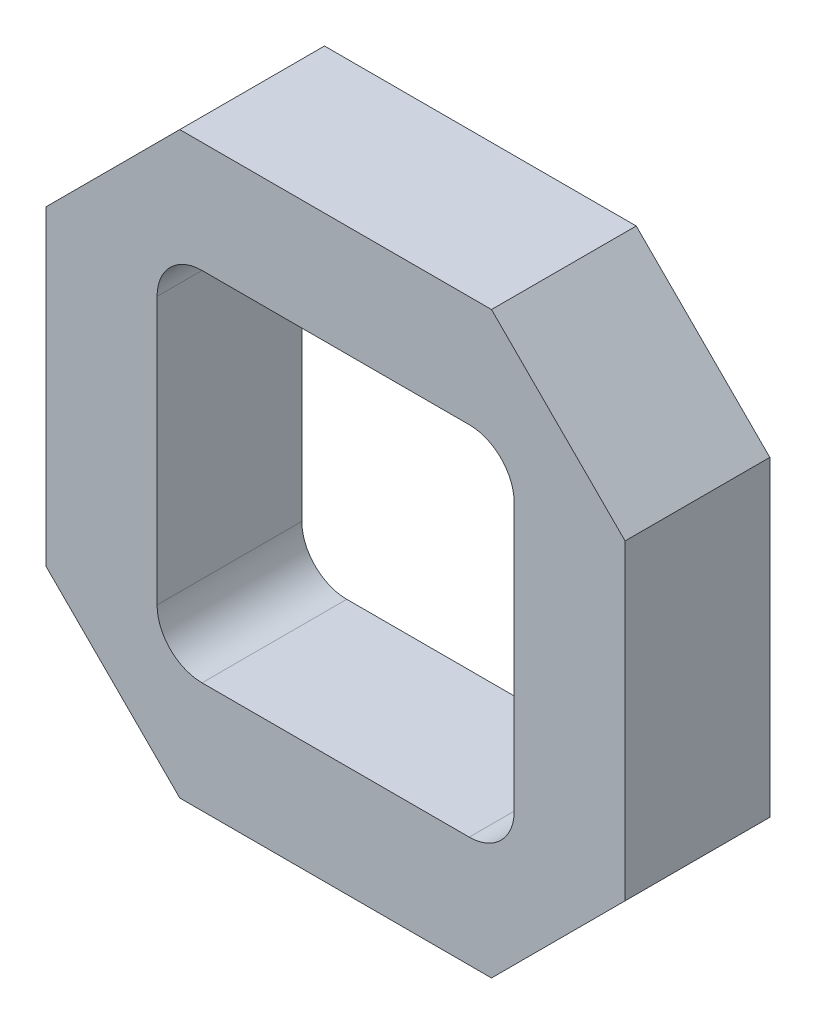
ISO-10303-21;
HEADER;
FILE_DESCRIPTION(('STEP AP214'),'2;1');
FILE_NAME('part.step','',(''),(''),'','','');
FILE_SCHEMA(('AUTOMOTIVE_DESIGN { 1 0 10303 214 1 1 1 1 }'));
ENDSEC;
DATA;
#1=APPLICATION_CONTEXT('core data for automotive mechanical design processes');
#2=APPLICATION_PROTOCOL_DEFINITION('international standard','automotive_design',2000,#1);
#3=PRODUCT_CONTEXT('',#1,'mechanical');
#4=PRODUCT('Part','Part','',(#3));
#5=PRODUCT_RELATED_PRODUCT_CATEGORY('part','',(#4));
#6=PRODUCT_DEFINITION_FORMATION('','',#4);
#7=PRODUCT_DEFINITION_CONTEXT('part definition',#1,'design');
#8=PRODUCT_DEFINITION('design','',#6,#7);
#9=PRODUCT_DEFINITION_SHAPE('','',#8);
#10=(LENGTH_UNIT() NAMED_UNIT(*) SI_UNIT(.MILLI.,.METRE.));
#11=(NAMED_UNIT(*) PLANE_ANGLE_UNIT() SI_UNIT($,.RADIAN.));
#12=(NAMED_UNIT(*) SI_UNIT($,.STERADIAN.) SOLID_ANGLE_UNIT());
#13=UNCERTAINTY_MEASURE_WITH_UNIT(LENGTH_MEASURE(1.E-05),#10,'distance_accuracy_value','');
#14=(GEOMETRIC_REPRESENTATION_CONTEXT(3) GLOBAL_UNCERTAINTY_ASSIGNED_CONTEXT((#13)) GLOBAL_UNIT_ASSIGNED_CONTEXT((#10,
#11,#12)) REPRESENTATION_CONTEXT('',''));
#15=CARTESIAN_POINT('',(0.,0.,0.));
#16=DIRECTION('',(0.,0.,1.));
#17=DIRECTION('',(1.,0.,0.));
#18=AXIS2_PLACEMENT_3D('',#15,#16,#17);
#19=CARTESIAN_POINT('',(-165.1,165.1,101.6));
#20=DIRECTION('',(0.,-1.,0.));
#21=DIRECTION('',(1.,0.,0.));
#22=AXIS2_PLACEMENT_3D('',#19,#20,#21);
#23=PLANE('',#22);
#24=DIRECTION('',(1.,0.,0.));
#25=VECTOR('',#24,1.);
#26=CARTESIAN_POINT('',(-165.1,165.1,19.05));
#27=LINE('',#26,#25);
#28=CARTESIAN_POINT('',(-88.8999999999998,165.1,19.05));
#29=VERTEX_POINT('',#28);
#30=CARTESIAN_POINT('',(88.9,165.1,19.05));
#31=VERTEX_POINT('',#30);
#32=EDGE_CURVE('E70',#29,#31,#27,.T.);
#33=ORIENTED_EDGE('',*,*,#32,.F.);
#34=DIRECTION('',(0.,0.,1.));
#35=VECTOR('',#34,1.);
#36=CARTESIAN_POINT('',(-88.8999999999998,165.1,101.6));
#37=LINE('',#36,#35);
#38=CARTESIAN_POINT('',(-88.8999999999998,165.1,101.6));
#39=VERTEX_POINT('',#38);
#40=EDGE_CURVE('E176',#29,#39,#37,.T.);
#41=ORIENTED_EDGE('',*,*,#40,.T.);
#42=DIRECTION('',(-1.,0.,0.));
#43=VECTOR('',#42,1.);
#44=CARTESIAN_POINT('',(-165.1,165.1,101.6));
#45=LINE('',#44,#43);
#46=CARTESIAN_POINT('',(88.9,165.1,101.6));
#47=VERTEX_POINT('',#46);
#48=EDGE_CURVE('E222',#47,#39,#45,.T.);
#49=ORIENTED_EDGE('',*,*,#48,.F.);
#50=DIRECTION('',(0.,0.,-1.));
#51=VECTOR('',#50,1.);
#52=CARTESIAN_POINT('',(88.9,165.1,101.6));
#53=LINE('',#52,#51);
#54=EDGE_CURVE('E181',#47,#31,#53,.T.);
#55=ORIENTED_EDGE('',*,*,#54,.T.);
#56=EDGE_LOOP('',(#33,#41,#49,#55));
#57=FACE_BOUND('',#56,.T.);
#58=ADVANCED_FACE('F45',(#57),#23,.F.);
#59=CARTESIAN_POINT('',(-165.1,-165.1,101.6));
#60=DIRECTION('',(1.,0.,0.));
#61=DIRECTION('',(0.,1.,0.));
#62=AXIS2_PLACEMENT_3D('',#59,#60,#61);
#63=PLANE('',#62);
#64=DIRECTION('',(0.,1.,0.));
#65=VECTOR('',#64,1.);
#66=CARTESIAN_POINT('',(-165.1,-165.1,19.05));
#67=LINE('',#66,#65);
#68=CARTESIAN_POINT('',(-165.1,-88.8999999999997,19.05));
#69=VERTEX_POINT('',#68);
#70=CARTESIAN_POINT('',(-165.1,88.9,19.05));
#71=VERTEX_POINT('',#70);
#72=EDGE_CURVE('E316',#69,#71,#67,.T.);
#73=ORIENTED_EDGE('',*,*,#72,.F.);
#74=DIRECTION('',(0.,0.,1.));
#75=VECTOR('',#74,1.);
#76=CARTESIAN_POINT('',(-165.1,-88.8999999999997,101.6));
#77=LINE('',#76,#75);
#78=CARTESIAN_POINT('',(-165.1,-88.8999999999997,101.6));
#79=VERTEX_POINT('',#78);
#80=EDGE_CURVE('E197',#69,#79,#77,.T.);
#81=ORIENTED_EDGE('',*,*,#80,.T.);
#82=DIRECTION('',(0.,-1.,0.));
#83=VECTOR('',#82,1.);
#84=CARTESIAN_POINT('',(-165.1,-165.1,101.6));
#85=LINE('',#84,#83);
#86=CARTESIAN_POINT('',(-165.1,88.9,101.6));
#87=VERTEX_POINT('',#86);
#88=EDGE_CURVE('E218',#87,#79,#85,.T.);
#89=ORIENTED_EDGE('',*,*,#88,.F.);
#90=DIRECTION('',(0.,0.,-1.));
#91=VECTOR('',#90,1.);
#92=CARTESIAN_POINT('',(-165.1,88.9,101.6));
#93=LINE('',#92,#91);
#94=EDGE_CURVE('E200',#87,#71,#93,.T.);
#95=ORIENTED_EDGE('',*,*,#94,.T.);
#96=EDGE_LOOP('',(#73,#81,#89,#95));
#97=FACE_BOUND('',#96,.T.);
#98=ADVANCED_FACE('F391',(#97),#63,.F.);
#99=CARTESIAN_POINT('',(-165.1,-165.1,101.6));
#100=DIRECTION('',(0.,1.,0.));
#101=DIRECTION('',(-1.,0.,0.));
#102=AXIS2_PLACEMENT_3D('',#99,#100,#101);
#103=PLANE('',#102);
#104=DIRECTION('',(-1.,0.,0.));
#105=VECTOR('',#104,1.);
#106=CARTESIAN_POINT('',(-165.1,-165.1,19.05));
#107=LINE('',#106,#105);
#108=CARTESIAN_POINT('',(88.8999999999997,-165.1,19.05));
#109=VERTEX_POINT('',#108);
#110=CARTESIAN_POINT('',(-88.8999999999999,-165.1,19.05));
#111=VERTEX_POINT('',#110);
#112=EDGE_CURVE('E319',#109,#111,#107,.T.);
#113=ORIENTED_EDGE('',*,*,#112,.F.);
#114=DIRECTION('',(0.,0.,1.));
#115=VECTOR('',#114,1.);
#116=CARTESIAN_POINT('',(88.8999999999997,-165.1,101.6));
#117=LINE('',#116,#115);
#118=CARTESIAN_POINT('',(88.8999999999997,-165.1,101.6));
#119=VERTEX_POINT('',#118);
#120=EDGE_CURVE('E208',#109,#119,#117,.T.);
#121=ORIENTED_EDGE('',*,*,#120,.T.);
#122=DIRECTION('',(1.,0.,0.));
#123=VECTOR('',#122,1.);
#124=CARTESIAN_POINT('',(-165.1,-165.1,101.6));
#125=LINE('',#124,#123);
#126=CARTESIAN_POINT('',(-88.8999999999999,-165.1,101.6));
#127=VERTEX_POINT('',#126);
#128=EDGE_CURVE('E214',#127,#119,#125,.T.);
#129=ORIENTED_EDGE('',*,*,#128,.F.);
#130=DIRECTION('',(0.,0.,-1.));
#131=VECTOR('',#130,1.);
#132=CARTESIAN_POINT('',(-88.8999999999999,-165.1,101.6));
#133=LINE('',#132,#131);
#134=EDGE_CURVE('E204',#127,#111,#133,.T.);
#135=ORIENTED_EDGE('',*,*,#134,.T.);
#136=EDGE_LOOP('',(#113,#121,#129,#135));
#137=FACE_BOUND('',#136,.T.);
#138=ADVANCED_FACE('F382',(#137),#103,.F.);
#139=CARTESIAN_POINT('',(165.1,-165.1,101.6));
#140=DIRECTION('',(-1.,0.,0.));
#141=DIRECTION('',(0.,0.,1.));
#142=AXIS2_PLACEMENT_3D('',#139,#140,#141);
#143=PLANE('',#142);
#144=DIRECTION('',(0.,-1.,0.));
#145=VECTOR('',#144,1.);
#146=CARTESIAN_POINT('',(165.1,-165.1,19.05));
#147=LINE('',#146,#145);
#148=CARTESIAN_POINT('',(165.1,88.8999999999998,19.05));
#149=VERTEX_POINT('',#148);
#150=CARTESIAN_POINT('',(165.1,-88.9,19.05));
#151=VERTEX_POINT('',#150);
#152=EDGE_CURVE('E158',#149,#151,#147,.T.);
#153=ORIENTED_EDGE('',*,*,#152,.F.);
#154=DIRECTION('',(0.,0.,1.));
#155=VECTOR('',#154,1.);
#156=CARTESIAN_POINT('',(165.1,88.8999999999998,101.6));
#157=LINE('',#156,#155);
#158=CARTESIAN_POINT('',(165.1,88.8999999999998,101.6));
#159=VERTEX_POINT('',#158);
#160=EDGE_CURVE('E168',#149,#159,#157,.T.);
#161=ORIENTED_EDGE('',*,*,#160,.T.);
#162=DIRECTION('',(0.,1.,0.));
#163=VECTOR('',#162,1.);
#164=CARTESIAN_POINT('',(165.1,-165.1,101.6));
#165=LINE('',#164,#163);
#166=CARTESIAN_POINT('',(165.1,-88.9,101.6));
#167=VERTEX_POINT('',#166);
#168=EDGE_CURVE('E211',#167,#159,#165,.T.);
#169=ORIENTED_EDGE('',*,*,#168,.F.);
#170=DIRECTION('',(0.,0.,-1.));
#171=VECTOR('',#170,1.);
#172=CARTESIAN_POINT('',(165.1,-88.9,101.6));
#173=LINE('',#172,#171);
#174=EDGE_CURVE('E55',#167,#151,#173,.T.);
#175=ORIENTED_EDGE('',*,*,#174,.T.);
#176=EDGE_LOOP('',(#153,#161,#169,#175));
#177=FACE_BOUND('',#176,.T.);
#178=ADVANCED_FACE('F166',(#177),#143,.F.);
#179=CARTESIAN_POINT('',(-76.2,-76.2,101.6));
#180=DIRECTION('',(0.,0.,-1.));
#181=DIRECTION('',(-1.,0.,0.));
#182=AXIS2_PLACEMENT_3D('',#179,#180,#181);
#183=CYLINDRICAL_SURFACE('',#182,25.654);
#184=DIRECTION('',(0.,0.,-1.));
#185=VECTOR('',#184,1.);
#186=CARTESIAN_POINT('',(-76.2,-101.854,101.6));
#187=LINE('',#186,#185);
#188=CARTESIAN_POINT('',(-76.2,-101.854,101.6));
#189=VERTEX_POINT('',#188);
#190=CARTESIAN_POINT('',(-76.2,-101.854,19.05));
#191=VERTEX_POINT('',#190);
#192=EDGE_CURVE('E226',#189,#191,#187,.T.);
#193=ORIENTED_EDGE('',*,*,#192,.T.);
#194=CARTESIAN_POINT('',(-76.2,-76.2,19.05));
#195=DIRECTION('',(0.,0.,-1.));
#196=DIRECTION('',(-1.,0.,0.));
#197=AXIS2_PLACEMENT_3D('',#194,#195,#196);
#198=CIRCLE('',#197,25.654);
#199=CARTESIAN_POINT('',(-101.854,-76.2,19.05));
#200=VERTEX_POINT('',#199);
#201=EDGE_CURVE('E283',#191,#200,#198,.T.);
#202=ORIENTED_EDGE('',*,*,#201,.T.);
#203=DIRECTION('',(0.,0.,-1.));
#204=VECTOR('',#203,1.);
#205=CARTESIAN_POINT('',(-101.854,-76.2,101.6));
#206=LINE('',#205,#204);
#207=CARTESIAN_POINT('',(-101.854,-76.2,101.6));
#208=VERTEX_POINT('',#207);
#209=EDGE_CURVE('E254',#208,#200,#206,.T.);
#210=ORIENTED_EDGE('',*,*,#209,.F.);
#211=CARTESIAN_POINT('',(-76.2,-76.2,101.6));
#212=DIRECTION('',(0.,0.,1.));
#213=DIRECTION('',(1.,0.,0.));
#214=AXIS2_PLACEMENT_3D('',#211,#212,#213);
#215=CIRCLE('',#214,25.654);
#216=EDGE_CURVE('E280',#208,#189,#215,.T.);
#217=ORIENTED_EDGE('',*,*,#216,.T.);
#218=EDGE_LOOP('',(#193,#202,#210,#217));
#219=FACE_BOUND('',#218,.T.);
#220=ADVANCED_FACE('F435',(#219),#183,.F.);
#221=CARTESIAN_POINT('',(-76.2,-101.854,101.6));
#222=DIRECTION('',(0.,1.,0.));
#223=DIRECTION('',(-1.,0.,0.));
#224=AXIS2_PLACEMENT_3D('',#221,#222,#223);
#225=PLANE('',#224);
#226=DIRECTION('',(0.,0.,-1.));
#227=VECTOR('',#226,1.);
#228=CARTESIAN_POINT('',(76.2,-101.854,101.6));
#229=LINE('',#228,#227);
#230=CARTESIAN_POINT('',(76.2,-101.854,101.6));
#231=VERTEX_POINT('',#230);
#232=CARTESIAN_POINT('',(76.2,-101.854,19.05));
#233=VERTEX_POINT('',#232);
#234=EDGE_CURVE('E230',#231,#233,#229,.T.);
#235=ORIENTED_EDGE('',*,*,#234,.T.);
#236=DIRECTION('',(-1.,0.,0.));
#237=VECTOR('',#236,1.);
#238=CARTESIAN_POINT('',(-76.2,-101.854,19.05));
#239=LINE('',#238,#237);
#240=EDGE_CURVE('E287',#233,#191,#239,.T.);
#241=ORIENTED_EDGE('',*,*,#240,.T.);
#242=ORIENTED_EDGE('',*,*,#192,.F.);
#243=DIRECTION('',(1.,0.,0.));
#244=VECTOR('',#243,1.);
#245=CARTESIAN_POINT('',(-76.2,-101.854,101.6));
#246=LINE('',#245,#244);
#247=EDGE_CURVE('E277',#189,#231,#246,.T.);
#248=ORIENTED_EDGE('',*,*,#247,.T.);
#249=EDGE_LOOP('',(#235,#241,#242,#248));
#250=FACE_BOUND('',#249,.T.);
#251=ADVANCED_FACE('F413',(#250),#225,.T.);
#252=CARTESIAN_POINT('',(76.2,-76.2,101.6));
#253=DIRECTION('',(0.,0.,-1.));
#254=DIRECTION('',(-1.,0.,0.));
#255=AXIS2_PLACEMENT_3D('',#252,#253,#254);
#256=CYLINDRICAL_SURFACE('',#255,25.654);
#257=DIRECTION('',(0.,0.,-1.));
#258=VECTOR('',#257,1.);
#259=CARTESIAN_POINT('',(101.854,-76.2,101.6));
#260=LINE('',#259,#258);
#261=CARTESIAN_POINT('',(101.854,-76.2,101.6));
#262=VERTEX_POINT('',#261);
#263=CARTESIAN_POINT('',(101.854,-76.2,19.05));
#264=VERTEX_POINT('',#263);
#265=EDGE_CURVE('E234',#262,#264,#260,.T.);
#266=ORIENTED_EDGE('',*,*,#265,.T.);
#267=CARTESIAN_POINT('',(76.2,-76.2,19.05));
#268=DIRECTION('',(0.,0.,-1.));
#269=DIRECTION('',(-1.,0.,0.));
#270=AXIS2_PLACEMENT_3D('',#267,#268,#269);
#271=CIRCLE('',#270,25.654);
#272=EDGE_CURVE('E291',#264,#233,#271,.T.);
#273=ORIENTED_EDGE('',*,*,#272,.T.);
#274=ORIENTED_EDGE('',*,*,#234,.F.);
#275=CARTESIAN_POINT('',(76.2,-76.2,101.6));
#276=DIRECTION('',(0.,0.,1.));
#277=DIRECTION('',(1.,0.,0.));
#278=AXIS2_PLACEMENT_3D('',#275,#276,#277);
#279=CIRCLE('',#278,25.654);
#280=EDGE_CURVE('E274',#231,#262,#279,.T.);
#281=ORIENTED_EDGE('',*,*,#280,.T.);
#282=EDGE_LOOP('',(#266,#273,#274,#281));
#283=FACE_BOUND('',#282,.T.);
#284=ADVANCED_FACE('F415',(#283),#256,.F.);
#285=CARTESIAN_POINT('',(101.854,-76.2,101.6));
#286=DIRECTION('',(-1.,0.,0.));
#287=DIRECTION('',(0.,-1.,0.));
#288=AXIS2_PLACEMENT_3D('',#285,#286,#287);
#289=PLANE('',#288);
#290=DIRECTION('',(0.,0.,-1.));
#291=VECTOR('',#290,1.);
#292=CARTESIAN_POINT('',(101.854,76.2,101.6));
#293=LINE('',#292,#291);
#294=CARTESIAN_POINT('',(101.854,76.2,101.6));
#295=VERTEX_POINT('',#294);
#296=CARTESIAN_POINT('',(101.854,76.2,19.05));
#297=VERTEX_POINT('',#296);
#298=EDGE_CURVE('E238',#295,#297,#293,.T.);
#299=ORIENTED_EDGE('',*,*,#298,.T.);
#300=DIRECTION('',(0.,-1.,0.));
#301=VECTOR('',#300,1.);
#302=CARTESIAN_POINT('',(101.854,-76.2,19.05));
#303=LINE('',#302,#301);
#304=EDGE_CURVE('E295',#297,#264,#303,.T.);
#305=ORIENTED_EDGE('',*,*,#304,.T.);
#306=ORIENTED_EDGE('',*,*,#265,.F.);
#307=DIRECTION('',(0.,1.,0.));
#308=VECTOR('',#307,1.);
#309=CARTESIAN_POINT('',(101.854,-76.2,101.6));
#310=LINE('',#309,#308);
#311=EDGE_CURVE('E271',#262,#295,#310,.T.);
#312=ORIENTED_EDGE('',*,*,#311,.T.);
#313=EDGE_LOOP('',(#299,#305,#306,#312));
#314=FACE_BOUND('',#313,.T.);
#315=ADVANCED_FACE('F418',(#314),#289,.T.);
#316=CARTESIAN_POINT('',(76.2,76.2,101.6));
#317=DIRECTION('',(0.,0.,-1.));
#318=DIRECTION('',(-1.,0.,0.));
#319=AXIS2_PLACEMENT_3D('',#316,#317,#318);
#320=CYLINDRICAL_SURFACE('',#319,25.654);
#321=DIRECTION('',(0.,0.,-1.));
#322=VECTOR('',#321,1.);
#323=CARTESIAN_POINT('',(76.2,101.854,101.6));
#324=LINE('',#323,#322);
#325=CARTESIAN_POINT('',(76.2,101.854,101.6));
#326=VERTEX_POINT('',#325);
#327=CARTESIAN_POINT('',(76.2,101.854,19.05));
#328=VERTEX_POINT('',#327);
#329=EDGE_CURVE('E242',#326,#328,#324,.T.);
#330=ORIENTED_EDGE('',*,*,#329,.T.);
#331=CARTESIAN_POINT('',(76.2,76.2,19.05));
#332=DIRECTION('',(0.,0.,-1.));
#333=DIRECTION('',(-1.,0.,0.));
#334=AXIS2_PLACEMENT_3D('',#331,#332,#333);
#335=CIRCLE('',#334,25.654);
#336=EDGE_CURVE('E299',#328,#297,#335,.T.);
#337=ORIENTED_EDGE('',*,*,#336,.T.);
#338=ORIENTED_EDGE('',*,*,#298,.F.);
#339=CARTESIAN_POINT('',(76.2,76.2,101.6));
#340=DIRECTION('',(0.,0.,1.));
#341=DIRECTION('',(1.,0.,0.));
#342=AXIS2_PLACEMENT_3D('',#339,#340,#341);
#343=CIRCLE('',#342,25.654);
#344=EDGE_CURVE('E268',#295,#326,#343,.T.);
#345=ORIENTED_EDGE('',*,*,#344,.T.);
#346=EDGE_LOOP('',(#330,#337,#338,#345));
#347=FACE_BOUND('',#346,.T.);
#348=ADVANCED_FACE('F422',(#347),#320,.F.);
#349=CARTESIAN_POINT('',(76.2,101.854,101.6));
#350=DIRECTION('',(0.,-1.,0.));
#351=DIRECTION('',(1.,0.,0.));
#352=AXIS2_PLACEMENT_3D('',#349,#350,#351);
#353=PLANE('',#352);
#354=DIRECTION('',(0.,0.,-1.));
#355=VECTOR('',#354,1.);
#356=CARTESIAN_POINT('',(-76.2,101.854,101.6));
#357=LINE('',#356,#355);
#358=CARTESIAN_POINT('',(-76.2,101.854,101.6));
#359=VERTEX_POINT('',#358);
#360=CARTESIAN_POINT('',(-76.2,101.854,19.05));
#361=VERTEX_POINT('',#360);
#362=EDGE_CURVE('E246',#359,#361,#357,.T.);
#363=ORIENTED_EDGE('',*,*,#362,.T.);
#364=DIRECTION('',(1.,0.,0.));
#365=VECTOR('',#364,1.);
#366=CARTESIAN_POINT('',(76.2,101.854,19.05));
#367=LINE('',#366,#365);
#368=EDGE_CURVE('E303',#361,#328,#367,.T.);
#369=ORIENTED_EDGE('',*,*,#368,.T.);
#370=ORIENTED_EDGE('',*,*,#329,.F.);
#371=DIRECTION('',(-1.,0.,0.));
#372=VECTOR('',#371,1.);
#373=CARTESIAN_POINT('',(76.2,101.854,101.6));
#374=LINE('',#373,#372);
#375=EDGE_CURVE('E265',#326,#359,#374,.T.);
#376=ORIENTED_EDGE('',*,*,#375,.T.);
#377=EDGE_LOOP('',(#363,#369,#370,#376));
#378=FACE_BOUND('',#377,.T.);
#379=ADVANCED_FACE('F428',(#378),#353,.T.);
#380=CARTESIAN_POINT('',(-76.2,76.2,101.6));
#381=DIRECTION('',(0.,0.,-1.));
#382=DIRECTION('',(-1.,0.,0.));
#383=AXIS2_PLACEMENT_3D('',#380,#381,#382);
#384=CYLINDRICAL_SURFACE('',#383,25.654);
#385=DIRECTION('',(0.,0.,-1.));
#386=VECTOR('',#385,1.);
#387=CARTESIAN_POINT('',(-101.854,76.2,101.6));
#388=LINE('',#387,#386);
#389=CARTESIAN_POINT('',(-101.854,76.2,101.6));
#390=VERTEX_POINT('',#389);
#391=CARTESIAN_POINT('',(-101.854,76.2,19.05));
#392=VERTEX_POINT('',#391);
#393=EDGE_CURVE('E250',#390,#392,#388,.T.);
#394=ORIENTED_EDGE('',*,*,#393,.T.);
#395=CARTESIAN_POINT('',(-76.2,76.2,19.05));
#396=DIRECTION('',(0.,0.,-1.));
#397=DIRECTION('',(-1.,0.,0.));
#398=AXIS2_PLACEMENT_3D('',#395,#396,#397);
#399=CIRCLE('',#398,25.654);
#400=EDGE_CURVE('E62',#392,#361,#399,.T.);
#401=ORIENTED_EDGE('',*,*,#400,.T.);
#402=ORIENTED_EDGE('',*,*,#362,.F.);
#403=CARTESIAN_POINT('',(-76.2,76.2,101.6));
#404=DIRECTION('',(0.,0.,1.));
#405=DIRECTION('',(1.,0.,0.));
#406=AXIS2_PLACEMENT_3D('',#403,#404,#405);
#407=CIRCLE('',#406,25.654);
#408=EDGE_CURVE('E261',#359,#390,#407,.T.);
#409=ORIENTED_EDGE('',*,*,#408,.T.);
#410=EDGE_LOOP('',(#394,#401,#402,#409));
#411=FACE_BOUND('',#410,.T.);
#412=ADVANCED_FACE('F430',(#411),#384,.F.);
#413=CARTESIAN_POINT('',(-101.854,76.2,101.6));
#414=DIRECTION('',(1.,0.,0.));
#415=DIRECTION('',(0.,1.,0.));
#416=AXIS2_PLACEMENT_3D('',#413,#414,#415);
#417=PLANE('',#416);
#418=ORIENTED_EDGE('',*,*,#209,.T.);
#419=DIRECTION('',(0.,1.,0.));
#420=VECTOR('',#419,1.);
#421=CARTESIAN_POINT('',(-101.854,76.2,19.05));
#422=LINE('',#421,#420);
#423=EDGE_CURVE('E309',#200,#392,#422,.T.);
#424=ORIENTED_EDGE('',*,*,#423,.T.);
#425=ORIENTED_EDGE('',*,*,#393,.F.);
#426=DIRECTION('',(0.,-1.,0.));
#427=VECTOR('',#426,1.);
#428=CARTESIAN_POINT('',(-101.854,76.2,101.6));
#429=LINE('',#428,#427);
#430=EDGE_CURVE('E258',#390,#208,#429,.T.);
#431=ORIENTED_EDGE('',*,*,#430,.T.);
#432=EDGE_LOOP('',(#418,#424,#425,#431));
#433=FACE_BOUND('',#432,.T.);
#434=ADVANCED_FACE('F432',(#433),#417,.T.);
#435=CARTESIAN_POINT('',(-88.8999999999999,-165.1,101.6));
#436=DIRECTION('',(0.707106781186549,0.707106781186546,0.));
#437=DIRECTION('',(0.,0.,-1.));
#438=AXIS2_PLACEMENT_3D('',#435,#436,#437);
#439=PLANE('',#438);
#440=ORIENTED_EDGE('',*,*,#80,.F.);
#441=DIRECTION('',(-0.707106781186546,0.707106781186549,0.));
#442=VECTOR('',#441,1.);
#443=CARTESIAN_POINT('',(-88.8999999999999,-165.1,19.05));
#444=LINE('',#443,#442);
#445=EDGE_CURVE('E312',#69,#111,#444,.F.);
#446=ORIENTED_EDGE('',*,*,#445,.T.);
#447=ORIENTED_EDGE('',*,*,#134,.F.);
#448=DIRECTION('',(-0.707106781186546,0.707106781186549,0.));
#449=VECTOR('',#448,1.);
#450=CARTESIAN_POINT('',(-127.,-127.,101.6));
#451=LINE('',#450,#449);
#452=EDGE_CURVE('E186',#79,#127,#451,.F.);
#453=ORIENTED_EDGE('',*,*,#452,.F.);
#454=EDGE_LOOP('',(#440,#446,#447,#453));
#455=FACE_BOUND('',#454,.T.);
#456=ADVANCED_FACE('F388',(#455),#439,.F.);
#457=CARTESIAN_POINT('',(-165.1,88.9,101.6));
#458=DIRECTION('',(0.707106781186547,-0.707106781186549,0.));
#459=DIRECTION('',(0.,0.,-1.));
#460=AXIS2_PLACEMENT_3D('',#457,#458,#459);
#461=PLANE('',#460);
#462=ORIENTED_EDGE('',*,*,#40,.F.);
#463=DIRECTION('',(0.707106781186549,0.707106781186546,0.));
#464=VECTOR('',#463,1.);
#465=CARTESIAN_POINT('',(-165.1,88.9,19.05));
#466=LINE('',#465,#464);
#467=EDGE_CURVE('E322',#29,#71,#466,.F.);
#468=ORIENTED_EDGE('',*,*,#467,.T.);
#469=ORIENTED_EDGE('',*,*,#94,.F.);
#470=DIRECTION('',(0.707106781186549,0.707106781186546,0.));
#471=VECTOR('',#470,1.);
#472=CARTESIAN_POINT('',(-127.,127.,101.6));
#473=LINE('',#472,#471);
#474=EDGE_CURVE('E189',#39,#87,#473,.F.);
#475=ORIENTED_EDGE('',*,*,#474,.F.);
#476=EDGE_LOOP('',(#462,#468,#469,#475));
#477=FACE_BOUND('',#476,.T.);
#478=ADVANCED_FACE('F397',(#477),#461,.F.);
#479=CARTESIAN_POINT('',(165.1,-88.9,101.6));
#480=DIRECTION('',(-0.707106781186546,0.707106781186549,0.));
#481=DIRECTION('',(0.,0.,-1.));
#482=AXIS2_PLACEMENT_3D('',#479,#480,#481);
#483=PLANE('',#482);
#484=ORIENTED_EDGE('',*,*,#120,.F.);
#485=DIRECTION('',(-0.707106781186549,-0.707106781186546,0.));
#486=VECTOR('',#485,1.);
#487=CARTESIAN_POINT('',(165.1,-88.9,19.05));
#488=LINE('',#487,#486);
#489=EDGE_CURVE('E326',#109,#151,#488,.F.);
#490=ORIENTED_EDGE('',*,*,#489,.T.);
#491=ORIENTED_EDGE('',*,*,#174,.F.);
#492=DIRECTION('',(-0.707106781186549,-0.707106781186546,0.));
#493=VECTOR('',#492,1.);
#494=CARTESIAN_POINT('',(127.,-127.,101.6));
#495=LINE('',#494,#493);
#496=EDGE_CURVE('E192',#119,#167,#495,.F.);
#497=ORIENTED_EDGE('',*,*,#496,.F.);
#498=EDGE_LOOP('',(#484,#490,#491,#497));
#499=FACE_BOUND('',#498,.T.);
#500=ADVANCED_FACE('F378',(#499),#483,.F.);
#501=CARTESIAN_POINT('',(88.9,165.1,101.6));
#502=DIRECTION('',(-0.707106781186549,-0.707106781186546,0.));
#503=DIRECTION('',(0.,0.,-1.));
#504=AXIS2_PLACEMENT_3D('',#501,#502,#503);
#505=PLANE('',#504);
#506=ORIENTED_EDGE('',*,*,#160,.F.);
#507=DIRECTION('',(0.707106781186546,-0.707106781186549,0.));
#508=VECTOR('',#507,1.);
#509=CARTESIAN_POINT('',(88.9,165.1,19.05));
#510=LINE('',#509,#508);
#511=EDGE_CURVE('E11',#149,#31,#510,.F.);
#512=ORIENTED_EDGE('',*,*,#511,.T.);
#513=ORIENTED_EDGE('',*,*,#54,.F.);
#514=DIRECTION('',(0.707106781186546,-0.707106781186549,0.));
#515=VECTOR('',#514,1.);
#516=CARTESIAN_POINT('',(127.,127.,101.6));
#517=LINE('',#516,#515);
#518=EDGE_CURVE('E174',#159,#47,#517,.F.);
#519=ORIENTED_EDGE('',*,*,#518,.F.);
#520=EDGE_LOOP('',(#506,#512,#513,#519));
#521=FACE_BOUND('',#520,.T.);
#522=ADVANCED_FACE('F48',(#521),#505,.F.);
#523=CARTESIAN_POINT('',(0.,0.,101.6));
#524=DIRECTION('',(0.,0.,1.));
#525=DIRECTION('',(1.,0.,0.));
#526=AXIS2_PLACEMENT_3D('',#523,#524,#525);
#527=PLANE('',#526);
#528=ORIENTED_EDGE('',*,*,#88,.T.);
#529=ORIENTED_EDGE('',*,*,#452,.T.);
#530=ORIENTED_EDGE('',*,*,#128,.T.);
#531=ORIENTED_EDGE('',*,*,#496,.T.);
#532=ORIENTED_EDGE('',*,*,#168,.T.);
#533=ORIENTED_EDGE('',*,*,#518,.T.);
#534=ORIENTED_EDGE('',*,*,#48,.T.);
#535=ORIENTED_EDGE('',*,*,#474,.T.);
#536=EDGE_LOOP('',(#528,#529,#530,#531,#532,#533,#534,#535));
#537=FACE_BOUND('',#536,.T.);
#538=ORIENTED_EDGE('',*,*,#247,.F.);
#539=ORIENTED_EDGE('',*,*,#216,.F.);
#540=ORIENTED_EDGE('',*,*,#430,.F.);
#541=ORIENTED_EDGE('',*,*,#408,.F.);
#542=ORIENTED_EDGE('',*,*,#375,.F.);
#543=ORIENTED_EDGE('',*,*,#344,.F.);
#544=ORIENTED_EDGE('',*,*,#311,.F.);
#545=ORIENTED_EDGE('',*,*,#280,.F.);
#546=EDGE_LOOP('',(#538,#539,#540,#541,#542,#543,#544,#545));
#547=FACE_BOUND('',#546,.T.);
#548=ADVANCED_FACE('F401',(#537,#547),#527,.T.);
#549=CARTESIAN_POINT('',(0.,0.,19.05));
#550=DIRECTION('',(0.,0.,-1.));
#551=DIRECTION('',(-1.,0.,0.));
#552=AXIS2_PLACEMENT_3D('',#549,#550,#551);
#553=PLANE('',#552);
#554=ORIENTED_EDGE('',*,*,#240,.F.);
#555=ORIENTED_EDGE('',*,*,#272,.F.);
#556=ORIENTED_EDGE('',*,*,#304,.F.);
#557=ORIENTED_EDGE('',*,*,#336,.F.);
#558=ORIENTED_EDGE('',*,*,#368,.F.);
#559=ORIENTED_EDGE('',*,*,#400,.F.);
#560=ORIENTED_EDGE('',*,*,#423,.F.);
#561=ORIENTED_EDGE('',*,*,#201,.F.);
#562=EDGE_LOOP('',(#554,#555,#556,#557,#558,#559,#560,#561));
#563=FACE_BOUND('',#562,.T.);
#564=ORIENTED_EDGE('',*,*,#72,.T.);
#565=ORIENTED_EDGE('',*,*,#467,.F.);
#566=ORIENTED_EDGE('',*,*,#32,.T.);
#567=ORIENTED_EDGE('',*,*,#511,.F.);
#568=ORIENTED_EDGE('',*,*,#152,.T.);
#569=ORIENTED_EDGE('',*,*,#489,.F.);
#570=ORIENTED_EDGE('',*,*,#112,.T.);
#571=ORIENTED_EDGE('',*,*,#445,.F.);
#572=EDGE_LOOP('',(#564,#565,#566,#567,#568,#569,#570,#571));
#573=FACE_BOUND('',#572,.T.);
#574=ADVANCED_FACE('F157',(#563,#573),#553,.T.);
#575=CLOSED_SHELL('',(#58,#98,#138,#178,#220,#251,#284,#315,#348,#379,#412,#434,#456,#478,#500,
#522,#548,#574));
#576=MANIFOLD_SOLID_BREP('B2',#575);
#577=ADVANCED_BREP_SHAPE_REPRESENTATION('',(#18,#576),#14);
#578=SHAPE_DEFINITION_REPRESENTATION(#9,#577);
ENDSEC;
END-ISO-10303-21;
